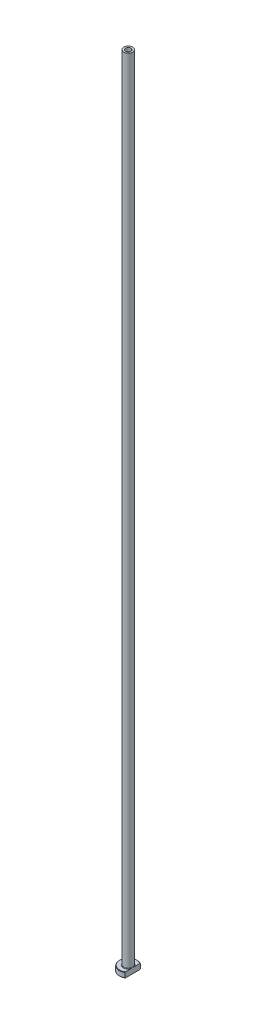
from build123d import *

# Parameters (mm, degrees)
FILLET1_R          = 0.3
CHAMFER1_SIZE      = 0.2
CUT_EXTRUDE1_DEPTH = 451.055552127
CHAMFER2_SIZE      = 0.5


with BuildPart() as part:
    # Sketch1 → Revolve1 (revolve)
    with BuildSketch(Plane.XY, mode=Mode.PRIVATE) as revolve1_sk:
        Polygon((-1.5, 450), (-2.5, 450), (-2.5, 3), (-5, 3), (-5, 0), (-1.75, 0), (-1.75, 393), (-1.5, 405), align=None)
    revolve(revolve1_sk.sketch.rotate(Axis((0, 92.187680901, 0), (0, -1, 0)), 270), axis=Axis((0, 92.187680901, 0), (0, -1, 0)))

    # Fillet1
    fillet1_edges = [part.edges().sort_by_distance(p)[0] for p in [
        (0, 3, -2.5),
    ]]
    fillet(fillet1_edges, radius=FILLET1_R)

    # Chamfer1
    chamfer1_edges = [part.edges().sort_by_distance(p)[0] for p in [
        (0, 0, -5),
        (0, 3, -5),
    ]]
    chamfer(chamfer1_edges, length=CHAMFER1_SIZE)

    # Sketch2 → Cut-Extrude1 (cut, through all)
    with BuildSketch(Plane.XZ):
        with BuildLine():
            Line((2.5, 4.330127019), (2.5, -4.330127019))
            ThreePointArc((2.5, -4.330127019), (5, 0), (2.5, 4.330127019))
        make_face()
    extrude(amount=-CUT_EXTRUDE1_DEPTH, mode=Mode.SUBTRACT)

    # Chamfer2
    chamfer2_edges = [part.edges().sort_by_distance(p)[0] for p in [
        (0, 0, -1.75),
    ]]
    chamfer(chamfer2_edges, length=CHAMFER2_SIZE)


solid = part.part
